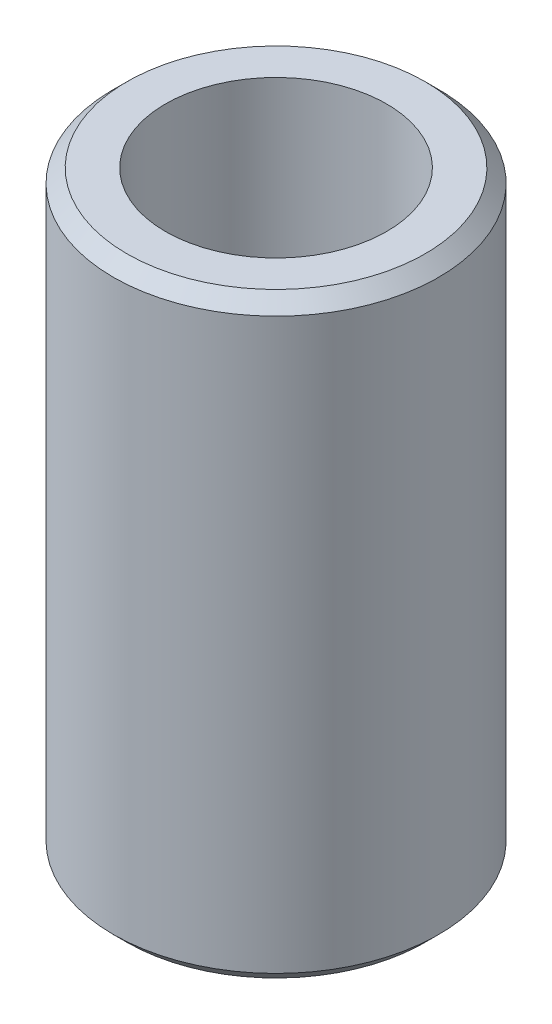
from build123d import *

# Parameters (mm, degrees)
SKETCH1_R      = 9.52754
EXTRUDE1_DEPTH = 17.4625
CHAMFER1_SIZE  = 0.79375
SKETCH2_R      = 6.477
EXTRUDE2_DEPTH = 38.433990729


with BuildPart() as part:
    # Sketch1 → Extrude1 (new, symmetric)
    with BuildSketch(Plane(origin=(0, 0, 0), x_dir=(1, 0, 0), z_dir=(0, 1, 0))):
        with Locations(Location((0, 0, 0), (0, 0, 270))):
            Circle(SKETCH1_R)
    extrude(amount=EXTRUDE1_DEPTH, both=True)

    # Chamfer1
    chamfer1_edges = [part.edges().sort_by_distance(p)[0] for p in [
        (0, -17.4625, -9.52754),
        (0, 17.4625, -9.52754),
    ]]
    chamfer(chamfer1_edges, length=CHAMFER1_SIZE)

    # Sketch2 → Extrude2 (cut, through all)
    with BuildSketch(Plane(origin=(0, 17.4625, 0), x_dir=(1, 0, 0), z_dir=(0, 1, 0))):
        with Locations(Location((0, 0, 0), (0, 0, 270))):
            Circle(SKETCH2_R)
    extrude(amount=-EXTRUDE2_DEPTH, mode=Mode.SUBTRACT)


solid = part.part
